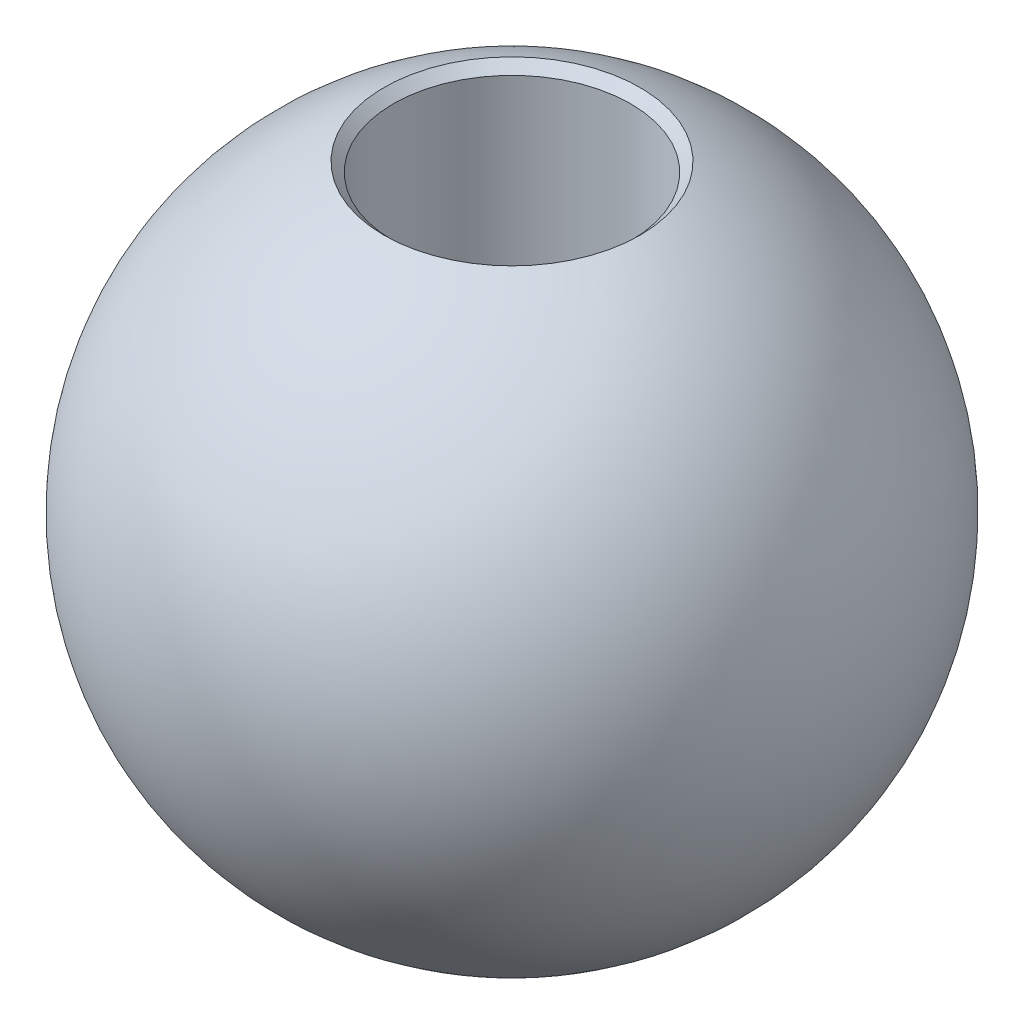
ISO-10303-21;
HEADER;
FILE_DESCRIPTION(('STEP AP214'),'2;1');
FILE_NAME('part.step','',(''),(''),'','','');
FILE_SCHEMA(('AUTOMOTIVE_DESIGN { 1 0 10303 214 1 1 1 1 }'));
ENDSEC;
DATA;
#1=APPLICATION_CONTEXT('core data for automotive mechanical design processes');
#2=APPLICATION_PROTOCOL_DEFINITION('international standard','automotive_design',2000,#1);
#3=PRODUCT_CONTEXT('',#1,'mechanical');
#4=PRODUCT('Part','Part','',(#3));
#5=PRODUCT_RELATED_PRODUCT_CATEGORY('part','',(#4));
#6=PRODUCT_DEFINITION_FORMATION('','',#4);
#7=PRODUCT_DEFINITION_CONTEXT('part definition',#1,'design');
#8=PRODUCT_DEFINITION('design','',#6,#7);
#9=PRODUCT_DEFINITION_SHAPE('','',#8);
#10=(LENGTH_UNIT() NAMED_UNIT(*) SI_UNIT(.MILLI.,.METRE.));
#11=(NAMED_UNIT(*) PLANE_ANGLE_UNIT() SI_UNIT($,.RADIAN.));
#12=(NAMED_UNIT(*) SI_UNIT($,.STERADIAN.) SOLID_ANGLE_UNIT());
#13=UNCERTAINTY_MEASURE_WITH_UNIT(LENGTH_MEASURE(1.E-05),#10,'distance_accuracy_value','');
#14=(GEOMETRIC_REPRESENTATION_CONTEXT(3) GLOBAL_UNCERTAINTY_ASSIGNED_CONTEXT((#13)) GLOBAL_UNIT_ASSIGNED_CONTEXT((#10,
#11,#12)) REPRESENTATION_CONTEXT('',''));
#15=CARTESIAN_POINT('',(0.,0.,0.));
#16=DIRECTION('',(0.,0.,1.));
#17=DIRECTION('',(1.,0.,0.));
#18=AXIS2_PLACEMENT_3D('',#15,#16,#17);
#19=CARTESIAN_POINT('',(0.,0.,0.));
#20=DIRECTION('',(0.,1.,0.));
#21=DIRECTION('',(1.,0.,0.));
#22=AXIS2_PLACEMENT_3D('',#19,#20,#21);
#23=SPHERICAL_SURFACE('',#22,12.5);
#24=CARTESIAN_POINT('',(-3.33066907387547E-13,11.5181223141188,0.));
#25=DIRECTION('',(0.,-1.,0.));
#26=DIRECTION('',(0.,0.,-1.));
#27=AXIS2_PLACEMENT_3D('',#24,#25,#26);
#28=CIRCLE('',#27,4.85621852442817);
#29=CARTESIAN_POINT('',(4.85621852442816,11.5181223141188,0.));
#30=VERTEX_POINT('',#29);
#31=EDGE_CURVE('E41',#30,#30,#28,.T.);
#32=CARTESIAN_POINT('',(0.,-11.5181223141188,-6.66133814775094E-13));
#33=DIRECTION('',(0.,1.,0.));
#34=DIRECTION('',(0.,0.,1.));
#35=AXIS2_PLACEMENT_3D('',#32,#33,#34);
#36=CIRCLE('',#35,4.85621852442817);
#37=CARTESIAN_POINT('',(4.85621852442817,-11.5181223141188,0.));
#38=VERTEX_POINT('',#37);
#39=EDGE_CURVE('E45',#38,#38,#36,.T.);
#40=CARTESIAN_POINT('',(4.85621852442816,11.5181223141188,0.));
#41=CARTESIAN_POINT('',(5.1374134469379,11.3995894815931,0.));
#42=CARTESIAN_POINT('',(5.4142482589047,11.2707222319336,0.));
#43=CARTESIAN_POINT('',(5.95775643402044,10.9930939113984,0.));
#44=CARTESIAN_POINT('',(6.22442979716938,10.8443328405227,0.));
#45=CARTESIAN_POINT('',(6.74617384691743,10.5276918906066,0.));
#46=CARTESIAN_POINT('',(7.00124453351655,10.3598120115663,0.));
#47=CARTESIAN_POINT('',(7.49841880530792,10.0058395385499,0.));
#48=CARTESIAN_POINT('',(7.74052239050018,9.81974694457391,0.));
#49=CARTESIAN_POINT('',(8.21046364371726,9.43034512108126,0.));
#50=CARTESIAN_POINT('',(8.43830131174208,9.22703589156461,0.));
#51=CARTESIAN_POINT('',(8.87848944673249,8.80429123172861,0.));
#52=CARTESIAN_POINT('',(9.09083991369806,8.58485580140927,0.));
#53=CARTESIAN_POINT('',(9.49891511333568,8.13103508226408,0.));
#54=CARTESIAN_POINT('',(9.69463984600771,7.89664979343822,0.));
#55=CARTESIAN_POINT('',(10.0684142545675,7.41418599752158,0.));
#56=CARTESIAN_POINT('',(10.2464639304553,7.1661074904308,0.));
#57=CARTESIAN_POINT('',(10.5839336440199,6.65758727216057,0.));
#58=CARTESIAN_POINT('',(10.7433536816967,6.39714556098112,0.));
#59=CARTESIAN_POINT('',(11.0427094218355,5.86529524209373,0.));
#60=CARTESIAN_POINT('',(11.1826451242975,5.5938866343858,0.));
#61=CARTESIAN_POINT('',(11.4422819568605,5.04155762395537,0.));
#62=CARTESIAN_POINT('',(11.5619830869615,4.76063722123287,0.));
#63=CARTESIAN_POINT('',(11.7805090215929,4.19079071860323,0.));
#64=CARTESIAN_POINT('',(11.8793338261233,3.90186461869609,0.));
#65=CARTESIAN_POINT('',(12.0555772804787,3.31755574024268,0.));
#66=CARTESIAN_POINT('',(12.1329959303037,3.02217296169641,0.));
#67=CARTESIAN_POINT('',(12.2660120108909,2.42653436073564,0.));
#68=CARTESIAN_POINT('',(12.3216094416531,2.12627853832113,0.));
#69=CARTESIAN_POINT('',(12.4106850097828,1.52250361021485,0.));
#70=CARTESIAN_POINT('',(12.4441631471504,1.21898450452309,0.));
#71=CARTESIAN_POINT('',(12.488820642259,0.610310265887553,0.));
#72=CARTESIAN_POINT('',(12.5,0.305155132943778,0.));
#73=CARTESIAN_POINT('',(12.5,-0.305155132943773,0.));
#74=CARTESIAN_POINT('',(12.488820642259,-0.610310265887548,0.));
#75=CARTESIAN_POINT('',(12.4441631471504,-1.21898450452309,0.));
#76=CARTESIAN_POINT('',(12.4106850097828,-1.52250361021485,0.));
#77=CARTESIAN_POINT('',(12.3216094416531,-2.12627853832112,0.));
#78=CARTESIAN_POINT('',(12.2660120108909,-2.42653436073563,0.));
#79=CARTESIAN_POINT('',(12.1329959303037,-3.02217296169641,0.));
#80=CARTESIAN_POINT('',(12.0555772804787,-3.31755574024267,0.));
#81=CARTESIAN_POINT('',(11.8793338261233,-3.90186461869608,0.));
#82=CARTESIAN_POINT('',(11.7805090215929,-4.19079071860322,0.));
#83=CARTESIAN_POINT('',(11.5619830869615,-4.76063722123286,0.));
#84=CARTESIAN_POINT('',(11.4422819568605,-5.04155762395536,0.));
#85=CARTESIAN_POINT('',(11.1826451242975,-5.59388663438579,0.));
#86=CARTESIAN_POINT('',(11.0427094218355,-5.86529524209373,0.));
#87=CARTESIAN_POINT('',(10.7433536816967,-6.39714556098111,0.));
#88=CARTESIAN_POINT('',(10.5839336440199,-6.65758727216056,0.));
#89=CARTESIAN_POINT('',(10.2464639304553,-7.1661074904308,0.));
#90=CARTESIAN_POINT('',(10.0684142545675,-7.41418599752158,0.));
#91=CARTESIAN_POINT('',(9.69463984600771,-7.89664979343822,0.));
#92=CARTESIAN_POINT('',(9.49891511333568,-8.13103508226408,0.));
#93=CARTESIAN_POINT('',(9.09083991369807,-8.58485580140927,0.));
#94=CARTESIAN_POINT('',(8.87848944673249,-8.80429123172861,0.));
#95=CARTESIAN_POINT('',(8.43830131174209,-9.2270358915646,0.));
#96=CARTESIAN_POINT('',(8.21046364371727,-9.43034512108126,0.));
#97=CARTESIAN_POINT('',(7.74052239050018,-9.81974694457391,0.));
#98=CARTESIAN_POINT('',(7.49841880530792,-10.0058395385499,0.));
#99=CARTESIAN_POINT('',(7.00124453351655,-10.3598120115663,0.));
#100=CARTESIAN_POINT('',(6.74617384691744,-10.5276918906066,0.));
#101=CARTESIAN_POINT('',(6.22442979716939,-10.8443328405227,0.));
#102=CARTESIAN_POINT('',(5.95775643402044,-10.9930939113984,0.));
#103=CARTESIAN_POINT('',(5.4142482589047,-11.2707222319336,0.));
#104=CARTESIAN_POINT('',(5.13741344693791,-11.3995894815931,0.));
#105=CARTESIAN_POINT('',(4.85621852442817,-11.5181223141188,0.));
#106=B_SPLINE_CURVE_WITH_KNOTS('',3,(#40,#41,#42,#43,#44,#45,#46,#47,#48,#49,#50,#51,#52,#53,
#54,#55,#56,#57,#58,#59,#60,#61,#62,#63,#64,#65,#66,#67,#68,#69,#70,#71,#72,#73,#74,#75,#76,#77,
#78,#79,#80,#81,#82,#83,#84,#85,#86,#87,#88,#89,#90,#91,#92,#93,#94,#95,#96,#97,#98,#99,#100,
#101,#102,#103,#104,#105),.UNSPECIFIED.,.F.,.F.,(4,2,2,2,2,2,2,2,2,2,2,2,2,2,2,2,2,2,2,2,2,2,2,
2,2,2,2,2,2,2,2,2,4),(0.,0.915260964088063,1.83052192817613,2.74578289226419,3.66104385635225,
4.57630482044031,5.49156578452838,6.40682674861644,7.3220877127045,8.23734867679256,
9.15260964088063,10.0678706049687,10.9831315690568,11.8983925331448,12.8136534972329,
13.7289144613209,14.644175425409,15.5594363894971,16.4746973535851,17.3899583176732,
18.3052192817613,19.2204802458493,20.1357412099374,21.0510021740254,21.9662631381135,
22.8815241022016,23.7967850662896,24.7120460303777,25.6273069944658,26.5425679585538,
27.4578289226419,28.3730898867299,29.288350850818),.UNSPECIFIED.);
#107=EDGE_CURVE('BSEAM31',#30,#38,#106,.T.);
#108=ORIENTED_EDGE('',*,*,#31,.T.);
#109=ORIENTED_EDGE('',*,*,#39,.T.);
#110=ORIENTED_EDGE('',*,*,#107,.T.);
#111=ORIENTED_EDGE('',*,*,#107,.F.);
#112=EDGE_LOOP('',(#108,#110,#109,#111));
#113=FACE_BOUND('',#112,.T.);
#114=ADVANCED_FACE('F31',(#113),#23,.T.);
#115=CARTESIAN_POINT('',(0.,-12.5,0.));
#116=DIRECTION('',(0.,1.,0.));
#117=DIRECTION('',(0.,0.,1.));
#118=AXIS2_PLACEMENT_3D('',#115,#116,#117);
#119=CYLINDRICAL_SURFACE('',#118,4.5);
#120=CARTESIAN_POINT('',(0.,11.1619037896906,0.));
#121=DIRECTION('',(0.,-1.,0.));
#122=DIRECTION('',(0.,0.,-1.));
#123=AXIS2_PLACEMENT_3D('',#120,#121,#122);
#124=CIRCLE('',#123,4.5);
#125=CARTESIAN_POINT('',(0.,11.1619037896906,-4.5));
#126=VERTEX_POINT('',#125);
#127=EDGE_CURVE('E10',#126,#126,#124,.F.);
#128=ORIENTED_EDGE('',*,*,#127,.T.);
#129=EDGE_LOOP('',(#128));
#130=FACE_BOUND('',#129,.T.);
#131=CARTESIAN_POINT('',(-3.88578058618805E-13,-11.1619037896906,-6.66133814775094E-13));
#132=DIRECTION('',(0.,1.,0.));
#133=DIRECTION('',(0.,0.,1.));
#134=AXIS2_PLACEMENT_3D('',#131,#132,#133);
#135=CIRCLE('',#134,4.5);
#136=CARTESIAN_POINT('',(-3.88578059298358E-13,-11.1619037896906,4.49999999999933));
#137=VERTEX_POINT('',#136);
#138=EDGE_CURVE('E37',#137,#137,#135,.F.);
#139=ORIENTED_EDGE('',*,*,#138,.T.);
#140=EDGE_LOOP('',(#139));
#141=FACE_BOUND('',#140,.T.);
#142=ADVANCED_FACE('F60',(#130,#141),#119,.F.);
#143=CARTESIAN_POINT('',(-3.33066907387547E-13,11.5181223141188,0.));
#144=DIRECTION('',(0.,1.,0.));
#145=DIRECTION('',(0.,0.,1.));
#146=AXIS2_PLACEMENT_3D('',#143,#144,#145);
#147=CONICAL_SURFACE('',#146,4.85621852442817,0.785398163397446);
#148=ORIENTED_EDGE('',*,*,#127,.F.);
#149=EDGE_LOOP('',(#148));
#150=FACE_BOUND('',#149,.T.);
#151=ORIENTED_EDGE('',*,*,#31,.F.);
#152=EDGE_LOOP('',(#151));
#153=FACE_BOUND('',#152,.T.);
#154=ADVANCED_FACE('F54',(#150,#153),#147,.F.);
#155=CARTESIAN_POINT('',(0.,-11.5181223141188,-6.66133814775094E-13));
#156=DIRECTION('',(0.,-1.,0.));
#157=DIRECTION('',(0.,0.,-1.));
#158=AXIS2_PLACEMENT_3D('',#155,#156,#157);
#159=CONICAL_SURFACE('',#158,4.85621852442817,0.785398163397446);
#160=ORIENTED_EDGE('',*,*,#138,.F.);
#161=EDGE_LOOP('',(#160));
#162=FACE_BOUND('',#161,.T.);
#163=ORIENTED_EDGE('',*,*,#39,.F.);
#164=EDGE_LOOP('',(#163));
#165=FACE_BOUND('',#164,.T.);
#166=ADVANCED_FACE('F52',(#162,#165),#159,.F.);
#167=CLOSED_SHELL('',(#114,#142,#154,#166));
#168=MANIFOLD_SOLID_BREP('B2',#167);
#169=ADVANCED_BREP_SHAPE_REPRESENTATION('',(#18,#168),#14);
#170=SHAPE_DEFINITION_REPRESENTATION(#9,#169);
ENDSEC;
END-ISO-10303-21;
